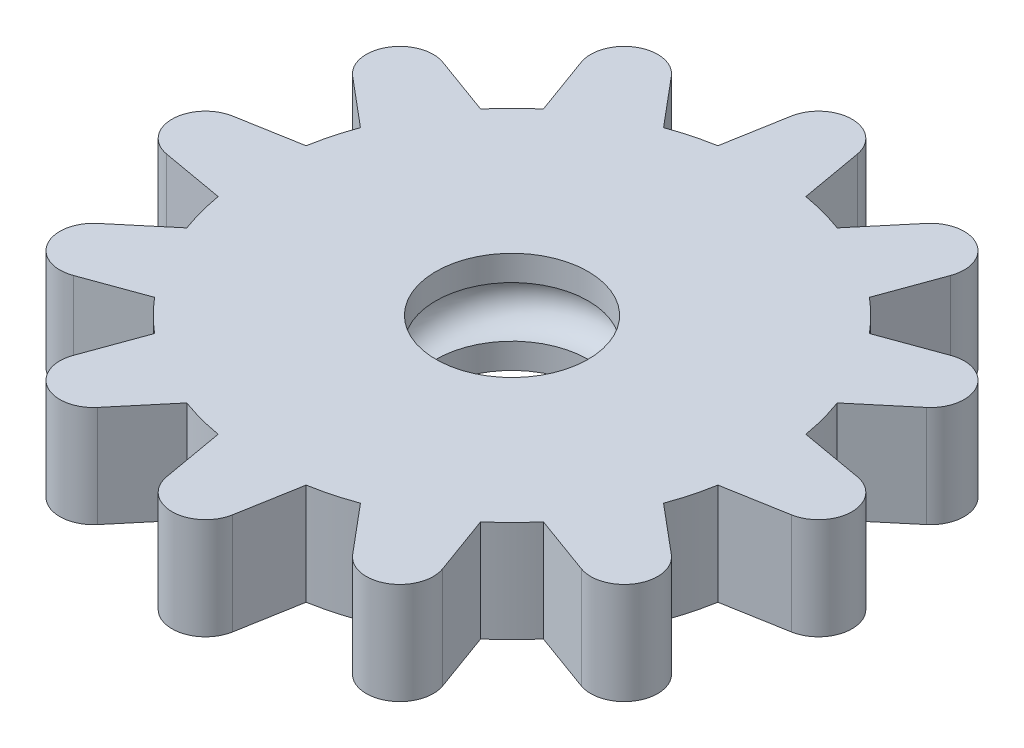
from build123d import *

# Parameters (mm, degrees)
SKETCH1_R           = 5
BOSS_EXTRUDE1_DEPTH = 2
BOSS_EXTRUDE4_DEPTH = 2
CIRPATTERN1_COUNT   = 12


with BuildPart() as part:
    # Sketch1 → Boss-Extrude1 (new body)
    with BuildSketch(Plane(origin=(0, 0, 0), x_dir=(1, 0, 0), z_dir=(0, 1, 0))):
        with Locations(Location((0, 0, 0), (0, 0, 270))):
            Circle(SKETCH1_R)
    extrude(amount=BOSS_EXTRUDE1_DEPTH)

    # Sketch2 → Boss-Extrude4 (add)
    with BuildSketch(Plane(origin=(0, 2, 0), x_dir=(1, 0, 0), z_dir=(0, 1, 0))):
        with BuildLine():
            Line((0.86693807, 4.924268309), (-0.86693807, 4.924268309))
            Line((-0.86693807, 4.924268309), (-0.65, 6.15458524))
            ThreePointArc((-0.65, 6.15458524), (0, 6.7), (0.65, 6.15458524))
            Line((0.65, 6.15458524), (0.86693807, 4.924268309))
        make_face()
    boss_extrude4 = extrude(amount=-BOSS_EXTRUDE4_DEPTH)

    # CirPattern1: Boss-Extrude4 ×12 about axis
    cirpattern1_axis = Axis((0, 0, 0), (0, 1, 0))
    for i in range(1, CIRPATTERN1_COUNT):
        add(boss_extrude4.rotate(cirpattern1_axis, i * 360 / CIRPATTERN1_COUNT))

    # Sketch4 → Cut-Revolve2 (revolve, cut)
    with BuildSketch(Plane(origin=(0, 0, 0), x_dir=(0, 0, -1), z_dir=(1, 0, 0))):
        with BuildLine():
            Line((0, 2), (1.5, 2))
            Line((1.5, 2), (1.5, 1.5))
            ThreePointArc((1.5, 1.5), (2, 1), (1.5, 0.5))
            Line((1.5, 0.5), (1.5, 0))
            Line((1.5, 0), (0, 0))
            Line((0, 0), (0, 2))
        make_face()
    revolve(axis=Axis((0, -2.057291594, 0), (0, 1, 0)), mode=Mode.SUBTRACT)


solid = part.part
